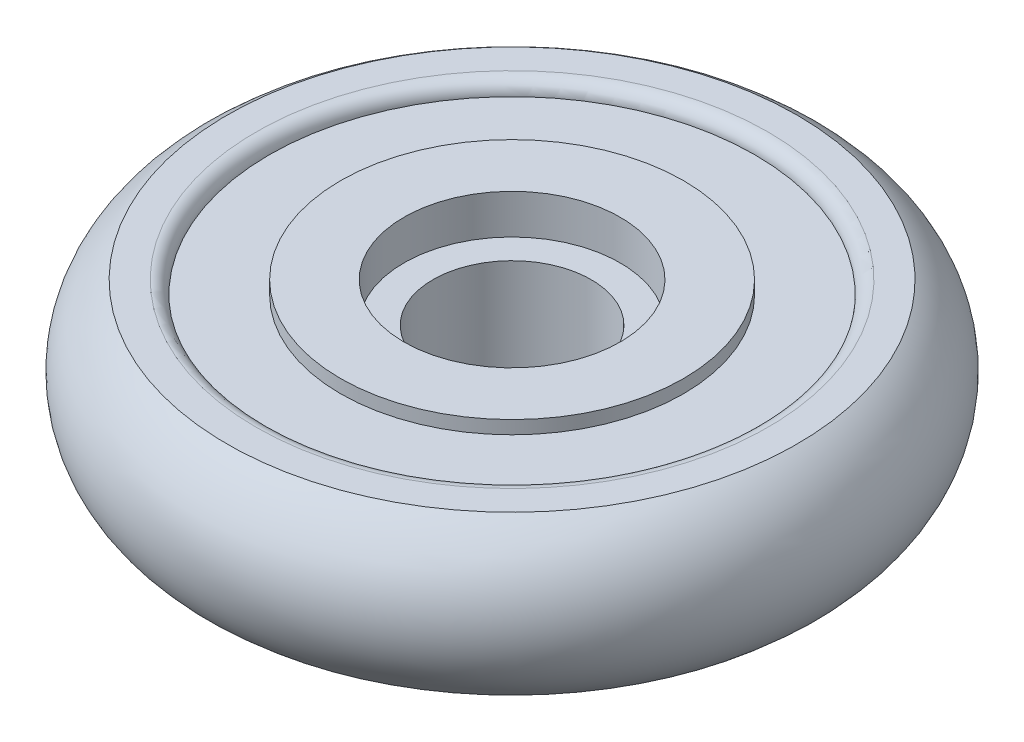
ISO-10303-21;
HEADER;
FILE_DESCRIPTION(('STEP AP214'),'2;1');
FILE_NAME('part.step','',(''),(''),'','','');
FILE_SCHEMA(('AUTOMOTIVE_DESIGN { 1 0 10303 214 1 1 1 1 }'));
ENDSEC;
DATA;
#1=APPLICATION_CONTEXT('core data for automotive mechanical design processes');
#2=APPLICATION_PROTOCOL_DEFINITION('international standard','automotive_design',2000,#1);
#3=PRODUCT_CONTEXT('',#1,'mechanical');
#4=PRODUCT('Part','Part','',(#3));
#5=PRODUCT_RELATED_PRODUCT_CATEGORY('part','',(#4));
#6=PRODUCT_DEFINITION_FORMATION('','',#4);
#7=PRODUCT_DEFINITION_CONTEXT('part definition',#1,'design');
#8=PRODUCT_DEFINITION('design','',#6,#7);
#9=PRODUCT_DEFINITION_SHAPE('','',#8);
#10=(LENGTH_UNIT() NAMED_UNIT(*) SI_UNIT(.MILLI.,.METRE.));
#11=(NAMED_UNIT(*) PLANE_ANGLE_UNIT() SI_UNIT($,.RADIAN.));
#12=(NAMED_UNIT(*) SI_UNIT($,.STERADIAN.) SOLID_ANGLE_UNIT());
#13=UNCERTAINTY_MEASURE_WITH_UNIT(LENGTH_MEASURE(1.E-05),#10,'distance_accuracy_value','');
#14=(GEOMETRIC_REPRESENTATION_CONTEXT(3) GLOBAL_UNCERTAINTY_ASSIGNED_CONTEXT((#13)) GLOBAL_UNIT_ASSIGNED_CONTEXT((#10,
#11,#12)) REPRESENTATION_CONTEXT('',''));
#15=CARTESIAN_POINT('',(0.,0.,0.));
#16=DIRECTION('',(0.,0.,1.));
#17=DIRECTION('',(1.,0.,0.));
#18=AXIS2_PLACEMENT_3D('',#15,#16,#17);
#19=CARTESIAN_POINT('',(0.,-8.99999999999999,0.));
#20=DIRECTION('',(0.,0.999999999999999,0.));
#21=DIRECTION('',(0.,0.,0.999999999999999));
#22=AXIS2_PLACEMENT_3D('',#19,#20,#21);
#23=CYLINDRICAL_SURFACE('',#22,3.);
#24=CARTESIAN_POINT('',(0.,-8.99999999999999,0.));
#25=DIRECTION('',(0.,0.999999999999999,0.));
#26=DIRECTION('',(0.,0.,0.999999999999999));
#27=AXIS2_PLACEMENT_3D('',#24,#25,#26);
#28=CIRCLE('',#27,3.);
#29=CARTESIAN_POINT('',(0.,-8.99999999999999,3.));
#30=VERTEX_POINT('',#29);
#31=EDGE_CURVE('E60',#30,#30,#28,.T.);
#32=CARTESIAN_POINT('',(0.,-1.5,0.));
#33=DIRECTION('',(0.,0.999999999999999,0.));
#34=DIRECTION('',(0.,0.,0.999999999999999));
#35=AXIS2_PLACEMENT_3D('',#32,#33,#34);
#36=CIRCLE('',#35,3.);
#37=CARTESIAN_POINT('',(0.,-1.5,3.));
#38=VERTEX_POINT('',#37);
#39=EDGE_CURVE('E82',#38,#38,#36,.T.);
#40=CARTESIAN_POINT('',(0.,-8.99999999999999,3.));
#41=CARTESIAN_POINT('',(0.,-8.92187499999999,3.));
#42=CARTESIAN_POINT('',(0.,-8.84374999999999,3.));
#43=CARTESIAN_POINT('',(0.,-8.68749999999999,3.));
#44=CARTESIAN_POINT('',(0.,-8.60937499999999,3.));
#45=CARTESIAN_POINT('',(0.,-8.45312499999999,3.));
#46=CARTESIAN_POINT('',(0.,-8.37499999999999,3.));
#47=CARTESIAN_POINT('',(0.,-8.21874999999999,3.));
#48=CARTESIAN_POINT('',(0.,-8.14062499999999,3.));
#49=CARTESIAN_POINT('',(0.,-7.98437499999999,3.));
#50=CARTESIAN_POINT('',(0.,-7.90624999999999,3.));
#51=CARTESIAN_POINT('',(0.,-7.74999999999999,3.));
#52=CARTESIAN_POINT('',(0.,-7.67187499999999,3.));
#53=CARTESIAN_POINT('',(0.,-7.51562499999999,3.));
#54=CARTESIAN_POINT('',(0.,-7.43749999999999,3.));
#55=CARTESIAN_POINT('',(0.,-7.28124999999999,3.));
#56=CARTESIAN_POINT('',(0.,-7.20312499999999,3.));
#57=CARTESIAN_POINT('',(0.,-7.04687499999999,3.));
#58=CARTESIAN_POINT('',(0.,-6.96874999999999,3.));
#59=CARTESIAN_POINT('',(0.,-6.81249999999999,3.));
#60=CARTESIAN_POINT('',(0.,-6.73437499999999,3.));
#61=CARTESIAN_POINT('',(0.,-6.57812499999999,3.));
#62=CARTESIAN_POINT('',(0.,-6.49999999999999,3.));
#63=CARTESIAN_POINT('',(0.,-6.34374999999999,3.));
#64=CARTESIAN_POINT('',(0.,-6.26562499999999,3.));
#65=CARTESIAN_POINT('',(0.,-6.10937499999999,3.));
#66=CARTESIAN_POINT('',(0.,-6.03124999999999,3.));
#67=CARTESIAN_POINT('',(0.,-5.87499999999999,3.));
#68=CARTESIAN_POINT('',(0.,-5.79687499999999,3.));
#69=CARTESIAN_POINT('',(0.,-5.64062499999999,3.));
#70=CARTESIAN_POINT('',(0.,-5.56249999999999,3.));
#71=CARTESIAN_POINT('',(0.,-5.40624999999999,3.));
#72=CARTESIAN_POINT('',(0.,-5.32812499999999,3.));
#73=CARTESIAN_POINT('',(0.,-5.17187499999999,3.));
#74=CARTESIAN_POINT('',(0.,-5.09374999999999,3.));
#75=CARTESIAN_POINT('',(0.,-4.93749999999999,3.));
#76=CARTESIAN_POINT('',(0.,-4.85937499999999,3.));
#77=CARTESIAN_POINT('',(0.,-4.70312499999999,3.));
#78=CARTESIAN_POINT('',(0.,-4.62499999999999,3.));
#79=CARTESIAN_POINT('',(0.,-4.46874999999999,3.));
#80=CARTESIAN_POINT('',(0.,-4.39062499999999,3.));
#81=CARTESIAN_POINT('',(0.,-4.23437499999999,3.));
#82=CARTESIAN_POINT('',(0.,-4.15624999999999,3.));
#83=CARTESIAN_POINT('',(0.,-3.99999999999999,3.));
#84=CARTESIAN_POINT('',(0.,-3.92187499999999,3.));
#85=CARTESIAN_POINT('',(0.,-3.765625,3.));
#86=CARTESIAN_POINT('',(0.,-3.6875,3.));
#87=CARTESIAN_POINT('',(0.,-3.53125,3.));
#88=CARTESIAN_POINT('',(0.,-3.453125,3.));
#89=CARTESIAN_POINT('',(0.,-3.296875,3.));
#90=CARTESIAN_POINT('',(0.,-3.21875,3.));
#91=CARTESIAN_POINT('',(0.,-3.0625,3.));
#92=CARTESIAN_POINT('',(0.,-2.984375,3.));
#93=CARTESIAN_POINT('',(0.,-2.828125,3.));
#94=CARTESIAN_POINT('',(0.,-2.75,3.));
#95=CARTESIAN_POINT('',(0.,-2.59375,3.));
#96=CARTESIAN_POINT('',(0.,-2.515625,3.));
#97=CARTESIAN_POINT('',(0.,-2.359375,3.));
#98=CARTESIAN_POINT('',(0.,-2.28125,3.));
#99=CARTESIAN_POINT('',(0.,-2.125,3.));
#100=CARTESIAN_POINT('',(0.,-2.046875,3.));
#101=CARTESIAN_POINT('',(0.,-1.890625,3.));
#102=CARTESIAN_POINT('',(0.,-1.8125,3.));
#103=CARTESIAN_POINT('',(0.,-1.65625,3.));
#104=CARTESIAN_POINT('',(0.,-1.578125,3.));
#105=CARTESIAN_POINT('',(0.,-1.5,3.));
#106=B_SPLINE_CURVE_WITH_KNOTS('',3,(#40,#41,#42,#43,#44,#45,#46,#47,#48,#49,#50,#51,#52,#53,
#54,#55,#56,#57,#58,#59,#60,#61,#62,#63,#64,#65,#66,#67,#68,#69,#70,#71,#72,#73,#74,#75,#76,#77,
#78,#79,#80,#81,#82,#83,#84,#85,#86,#87,#88,#89,#90,#91,#92,#93,#94,#95,#96,#97,#98,#99,#100,
#101,#102,#103,#104,#105),.UNSPECIFIED.,.F.,.F.,(4,2,2,2,2,2,2,2,2,2,2,2,2,2,2,2,2,2,2,2,2,2,2,
2,2,2,2,2,2,2,2,2,4),(0.,0.234375,0.46875,0.703124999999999,0.937499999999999,1.171875,1.40625,
1.640625,1.875,2.109375,2.34375,2.578125,2.8125,3.046875,3.28125,3.51562499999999,
3.74999999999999,3.98437499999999,4.21874999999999,4.45312499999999,4.68749999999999,
4.92187499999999,5.15624999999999,5.39062499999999,5.62499999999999,5.85937499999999,
6.09374999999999,6.32812499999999,6.56249999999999,6.79687499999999,7.03124999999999,
7.26562499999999,7.49999999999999),.UNSPECIFIED.);
#107=EDGE_CURVE('BSEAM34',#30,#38,#106,.T.);
#108=ORIENTED_EDGE('',*,*,#31,.F.);
#109=ORIENTED_EDGE('',*,*,#39,.T.);
#110=ORIENTED_EDGE('',*,*,#107,.T.);
#111=ORIENTED_EDGE('',*,*,#107,.F.);
#112=EDGE_LOOP('',(#108,#110,#109,#111));
#113=FACE_BOUND('',#112,.T.);
#114=ADVANCED_FACE('F34',(#113),#23,.F.);
#115=CARTESIAN_POINT('',(0.,0.,0.));
#116=DIRECTION('',(0.,0.999999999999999,0.));
#117=DIRECTION('',(0.,0.,0.999999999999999));
#118=AXIS2_PLACEMENT_3D('',#115,#116,#117);
#119=PLANE('',#118);
#120=CARTESIAN_POINT('',(0.,0.,0.));
#121=DIRECTION('',(0.,0.999999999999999,0.));
#122=DIRECTION('',(0.,0.,0.999999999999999));
#123=AXIS2_PLACEMENT_3D('',#120,#121,#122);
#124=CIRCLE('',#123,4.1);
#125=CARTESIAN_POINT('',(0.,0.,4.1));
#126=VERTEX_POINT('',#125);
#127=EDGE_CURVE('E79',#126,#126,#124,.T.);
#128=ORIENTED_EDGE('',*,*,#127,.F.);
#129=EDGE_LOOP('',(#128));
#130=FACE_BOUND('',#129,.T.);
#131=CARTESIAN_POINT('',(0.,0.,0.));
#132=DIRECTION('',(0.,0.999999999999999,0.));
#133=DIRECTION('',(0.,0.,0.999999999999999));
#134=AXIS2_PLACEMENT_3D('',#131,#132,#133);
#135=CIRCLE('',#134,6.5);
#136=CARTESIAN_POINT('',(0.,0.,6.5));
#137=VERTEX_POINT('',#136);
#138=EDGE_CURVE('E73',#137,#137,#135,.T.);
#139=ORIENTED_EDGE('',*,*,#138,.T.);
#140=EDGE_LOOP('',(#139));
#141=FACE_BOUND('',#140,.T.);
#142=ADVANCED_FACE('F102',(#130,#141),#119,.T.);
#143=CARTESIAN_POINT('',(0.,0.,0.));
#144=DIRECTION('',(0.,0.999999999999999,0.));
#145=DIRECTION('',(0.,0.,0.999999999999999));
#146=AXIS2_PLACEMENT_3D('',#143,#144,#145);
#147=CIRCLE('',#146,9.7);
#148=CARTESIAN_POINT('',(0.,0.,9.69999999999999));
#149=VERTEX_POINT('',#148);
#150=EDGE_CURVE('E45',#149,#149,#147,.F.);
#151=ORIENTED_EDGE('',*,*,#150,.T.);
#152=EDGE_LOOP('',(#151));
#153=FACE_BOUND('',#152,.T.);
#154=CARTESIAN_POINT('',(0.,0.,0.));
#155=DIRECTION('',(0.,-0.999999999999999,0.));
#156=DIRECTION('',(0.,0.,-0.999999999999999));
#157=AXIS2_PLACEMENT_3D('',#154,#155,#156);
#158=CIRCLE('',#157,10.802775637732);
#159=CARTESIAN_POINT('',(0.,0.,-10.802775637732));
#160=VERTEX_POINT('',#159);
#161=EDGE_CURVE('E54',#160,#160,#158,.T.);
#162=ORIENTED_EDGE('',*,*,#161,.F.);
#163=EDGE_LOOP('',(#162));
#164=FACE_BOUND('',#163,.T.);
#165=ADVANCED_FACE('F105',(#153,#164),#119,.T.);
#166=CARTESIAN_POINT('',(0.,-3.,0.));
#167=DIRECTION('',(0.,-0.999999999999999,0.));
#168=DIRECTION('',(0.,0.,-0.999999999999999));
#169=AXIS2_PLACEMENT_3D('',#166,#167,#168);
#170=TOROIDAL_SURFACE('',#169,9.,3.5);
#171=ORIENTED_EDGE('',*,*,#161,.T.);
#172=EDGE_LOOP('',(#171));
#173=FACE_BOUND('',#172,.T.);
#174=CARTESIAN_POINT('',(0.,-5.99999999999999,0.));
#175=DIRECTION('',(0.,-0.999999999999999,0.));
#176=DIRECTION('',(0.,0.,-0.999999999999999));
#177=AXIS2_PLACEMENT_3D('',#174,#175,#176);
#178=CIRCLE('',#177,10.802775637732);
#179=CARTESIAN_POINT('',(0.,-5.99999999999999,-10.802775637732));
#180=VERTEX_POINT('',#179);
#181=EDGE_CURVE('E57',#180,#180,#178,.T.);
#182=ORIENTED_EDGE('',*,*,#181,.F.);
#183=EDGE_LOOP('',(#182));
#184=FACE_BOUND('',#183,.T.);
#185=ADVANCED_FACE('F141',(#173,#184),#170,.T.);
#186=CARTESIAN_POINT('',(10.802775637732,-5.99999999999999,0.));
#187=DIRECTION('',(0.,-0.999999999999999,0.));
#188=DIRECTION('',(0.,0.,-0.999999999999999));
#189=AXIS2_PLACEMENT_3D('',#186,#187,#188);
#190=PLANE('',#189);
#191=CARTESIAN_POINT('',(0.,-5.99999999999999,0.));
#192=DIRECTION('',(0.,-0.999999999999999,0.));
#193=DIRECTION('',(0.,0.,-0.999999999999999));
#194=AXIS2_PLACEMENT_3D('',#191,#192,#193);
#195=CIRCLE('',#194,8.7);
#196=CARTESIAN_POINT('',(0.,-5.99999999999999,-8.69999999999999));
#197=VERTEX_POINT('',#196);
#198=EDGE_CURVE('E49',#197,#197,#195,.F.);
#199=ORIENTED_EDGE('',*,*,#198,.T.);
#200=EDGE_LOOP('',(#199));
#201=FACE_BOUND('',#200,.T.);
#202=ORIENTED_EDGE('',*,*,#181,.T.);
#203=EDGE_LOOP('',(#202));
#204=FACE_BOUND('',#203,.T.);
#205=ADVANCED_FACE('F138',(#201,#204),#190,.T.);
#206=CARTESIAN_POINT('',(0.,0.,0.));
#207=DIRECTION('',(0.,-0.999999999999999,0.));
#208=DIRECTION('',(0.,0.,-0.999999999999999));
#209=AXIS2_PLACEMENT_3D('',#206,#207,#208);
#210=CYLINDRICAL_SURFACE('',#209,5.5);
#211=CARTESIAN_POINT('',(0.,-8.79999999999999,0.));
#212=DIRECTION('',(0.,-0.999999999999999,0.));
#213=DIRECTION('',(0.,0.,-0.999999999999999));
#214=AXIS2_PLACEMENT_3D('',#211,#212,#213);
#215=CIRCLE('',#214,5.5);
#216=CARTESIAN_POINT('',(0.,-8.79999999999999,-5.5));
#217=VERTEX_POINT('',#216);
#218=EDGE_CURVE('E10',#217,#217,#215,.F.);
#219=CARTESIAN_POINT('',(0.,-5.49999999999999,0.));
#220=DIRECTION('',(0.,-0.999999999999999,0.));
#221=DIRECTION('',(0.,0.,-0.999999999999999));
#222=AXIS2_PLACEMENT_3D('',#219,#220,#221);
#223=CIRCLE('',#222,5.5);
#224=CARTESIAN_POINT('',(0.,-5.49999999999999,-5.5));
#225=VERTEX_POINT('',#224);
#226=EDGE_CURVE('E66',#225,#225,#223,.T.);
#227=CARTESIAN_POINT('',(0.,-8.79999999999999,-5.5));
#228=CARTESIAN_POINT('',(0.,-8.76562499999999,-5.5));
#229=CARTESIAN_POINT('',(0.,-8.73124999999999,-5.5));
#230=CARTESIAN_POINT('',(0.,-8.66249999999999,-5.5));
#231=CARTESIAN_POINT('',(0.,-8.62812499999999,-5.5));
#232=CARTESIAN_POINT('',(0.,-8.55937499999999,-5.5));
#233=CARTESIAN_POINT('',(0.,-8.52499999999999,-5.5));
#234=CARTESIAN_POINT('',(0.,-8.45624999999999,-5.5));
#235=CARTESIAN_POINT('',(0.,-8.42187499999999,-5.5));
#236=CARTESIAN_POINT('',(0.,-8.35312499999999,-5.5));
#237=CARTESIAN_POINT('',(0.,-8.31874999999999,-5.5));
#238=CARTESIAN_POINT('',(0.,-8.24999999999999,-5.5));
#239=CARTESIAN_POINT('',(0.,-8.21562499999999,-5.5));
#240=CARTESIAN_POINT('',(0.,-8.14687499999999,-5.5));
#241=CARTESIAN_POINT('',(0.,-8.11249999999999,-5.5));
#242=CARTESIAN_POINT('',(0.,-8.04374999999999,-5.5));
#243=CARTESIAN_POINT('',(0.,-8.00937499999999,-5.5));
#244=CARTESIAN_POINT('',(0.,-7.94062499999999,-5.5));
#245=CARTESIAN_POINT('',(0.,-7.90624999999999,-5.5));
#246=CARTESIAN_POINT('',(0.,-7.83749999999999,-5.5));
#247=CARTESIAN_POINT('',(0.,-7.80312499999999,-5.5));
#248=CARTESIAN_POINT('',(0.,-7.73437499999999,-5.5));
#249=CARTESIAN_POINT('',(0.,-7.69999999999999,-5.5));
#250=CARTESIAN_POINT('',(0.,-7.63124999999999,-5.5));
#251=CARTESIAN_POINT('',(0.,-7.59687499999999,-5.5));
#252=CARTESIAN_POINT('',(0.,-7.52812499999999,-5.5));
#253=CARTESIAN_POINT('',(0.,-7.49374999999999,-5.5));
#254=CARTESIAN_POINT('',(0.,-7.42499999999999,-5.5));
#255=CARTESIAN_POINT('',(0.,-7.39062499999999,-5.5));
#256=CARTESIAN_POINT('',(0.,-7.32187499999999,-5.5));
#257=CARTESIAN_POINT('',(0.,-7.28749999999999,-5.5));
#258=CARTESIAN_POINT('',(0.,-7.21874999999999,-5.5));
#259=CARTESIAN_POINT('',(0.,-7.18437499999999,-5.5));
#260=CARTESIAN_POINT('',(0.,-7.11562499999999,-5.5));
#261=CARTESIAN_POINT('',(0.,-7.08124999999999,-5.5));
#262=CARTESIAN_POINT('',(0.,-7.01249999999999,-5.5));
#263=CARTESIAN_POINT('',(0.,-6.97812499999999,-5.5));
#264=CARTESIAN_POINT('',(0.,-6.90937499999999,-5.5));
#265=CARTESIAN_POINT('',(0.,-6.87499999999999,-5.5));
#266=CARTESIAN_POINT('',(0.,-6.80624999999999,-5.5));
#267=CARTESIAN_POINT('',(0.,-6.77187499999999,-5.5));
#268=CARTESIAN_POINT('',(0.,-6.70312499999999,-5.5));
#269=CARTESIAN_POINT('',(0.,-6.66874999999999,-5.5));
#270=CARTESIAN_POINT('',(0.,-6.59999999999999,-5.5));
#271=CARTESIAN_POINT('',(0.,-6.56562499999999,-5.5));
#272=CARTESIAN_POINT('',(0.,-6.49687499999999,-5.5));
#273=CARTESIAN_POINT('',(0.,-6.46249999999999,-5.5));
#274=CARTESIAN_POINT('',(0.,-6.39374999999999,-5.5));
#275=CARTESIAN_POINT('',(0.,-6.35937499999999,-5.5));
#276=CARTESIAN_POINT('',(0.,-6.29062499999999,-5.5));
#277=CARTESIAN_POINT('',(0.,-6.25624999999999,-5.5));
#278=CARTESIAN_POINT('',(0.,-6.18749999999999,-5.5));
#279=CARTESIAN_POINT('',(0.,-6.15312499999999,-5.5));
#280=CARTESIAN_POINT('',(0.,-6.08437499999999,-5.5));
#281=CARTESIAN_POINT('',(0.,-6.04999999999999,-5.5));
#282=CARTESIAN_POINT('',(0.,-5.98124999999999,-5.5));
#283=CARTESIAN_POINT('',(0.,-5.94687499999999,-5.5));
#284=CARTESIAN_POINT('',(0.,-5.87812499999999,-5.5));
#285=CARTESIAN_POINT('',(0.,-5.84374999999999,-5.5));
#286=CARTESIAN_POINT('',(0.,-5.77499999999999,-5.5));
#287=CARTESIAN_POINT('',(0.,-5.74062499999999,-5.5));
#288=CARTESIAN_POINT('',(0.,-5.67187499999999,-5.5));
#289=CARTESIAN_POINT('',(0.,-5.63749999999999,-5.5));
#290=CARTESIAN_POINT('',(0.,-5.56874999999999,-5.5));
#291=CARTESIAN_POINT('',(0.,-5.53437499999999,-5.5));
#292=CARTESIAN_POINT('',(0.,-5.49999999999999,-5.5));
#293=B_SPLINE_CURVE_WITH_KNOTS('',3,(#227,#228,#229,#230,#231,#232,#233,#234,#235,#236,#237,
#238,#239,#240,#241,#242,#243,#244,#245,#246,#247,#248,#249,#250,#251,#252,#253,#254,#255,#256,
#257,#258,#259,#260,#261,#262,#263,#264,#265,#266,#267,#268,#269,#270,#271,#272,#273,#274,#275,
#276,#277,#278,#279,#280,#281,#282,#283,#284,#285,#286,#287,#288,#289,#290,#291,#292),
.UNSPECIFIED.,.F.,.F.,(4,2,2,2,2,2,2,2,2,2,2,2,2,2,2,2,2,2,2,2,2,2,2,2,2,2,2,2,2,2,2,2,4),(0.,
0.103124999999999,0.206249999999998,0.309374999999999,0.412499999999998,0.515624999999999,
0.618749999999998,0.721874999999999,0.824999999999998,0.928124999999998,1.03125,1.134375,1.2375,
1.340625,1.44375,1.546875,1.65,1.753125,1.85625,1.959375,2.0625,2.165625,2.26875,2.371875,2.475,
2.578125,2.68125,2.784375,2.8875,2.990625,3.09375,3.196875,3.3),.UNSPECIFIED.);
#294=EDGE_CURVE('BSEAM135',#217,#225,#293,.T.);
#295=ORIENTED_EDGE('',*,*,#218,.T.);
#296=ORIENTED_EDGE('',*,*,#226,.T.);
#297=ORIENTED_EDGE('',*,*,#294,.T.);
#298=ORIENTED_EDGE('',*,*,#294,.F.);
#299=EDGE_LOOP('',(#295,#297,#296,#298));
#300=FACE_BOUND('',#299,.T.);
#301=ADVANCED_FACE('F135',(#300),#210,.T.);
#302=CARTESIAN_POINT('',(5.50000000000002,-8.99999999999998,0.));
#303=DIRECTION('',(0.,-0.999999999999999,0.));
#304=DIRECTION('',(0.,0.,-0.999999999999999));
#305=AXIS2_PLACEMENT_3D('',#302,#303,#304);
#306=PLANE('',#305);
#307=CARTESIAN_POINT('',(0.,-8.99999999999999,0.));
#308=DIRECTION('',(0.,-0.999999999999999,0.));
#309=DIRECTION('',(0.,0.,-0.999999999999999));
#310=AXIS2_PLACEMENT_3D('',#307,#308,#309);
#311=CIRCLE('',#310,5.3);
#312=CARTESIAN_POINT('',(0.,-8.99999999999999,-5.3));
#313=VERTEX_POINT('',#312);
#314=EDGE_CURVE('E41',#313,#313,#311,.T.);
#315=ORIENTED_EDGE('',*,*,#314,.T.);
#316=EDGE_LOOP('',(#315));
#317=FACE_BOUND('',#316,.T.);
#318=ORIENTED_EDGE('',*,*,#31,.T.);
#319=EDGE_LOOP('',(#318));
#320=FACE_BOUND('',#319,.T.);
#321=ADVANCED_FACE('F132',(#317,#320),#306,.T.);
#322=CARTESIAN_POINT('',(0.,-5.49999999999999,0.));
#323=DIRECTION('',(0.,-0.999999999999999,0.));
#324=DIRECTION('',(0.,0.,-0.999999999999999));
#325=AXIS2_PLACEMENT_3D('',#322,#323,#324);
#326=PLANE('',#325);
#327=ORIENTED_EDGE('',*,*,#226,.F.);
#328=EDGE_LOOP('',(#327));
#329=FACE_BOUND('',#328,.T.);
#330=CARTESIAN_POINT('',(0.,-5.49999999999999,0.));
#331=DIRECTION('',(0.,-0.999999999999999,0.));
#332=DIRECTION('',(0.,0.,-0.999999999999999));
#333=AXIS2_PLACEMENT_3D('',#330,#331,#332);
#334=CIRCLE('',#333,8.2);
#335=CARTESIAN_POINT('',(0.,-5.49999999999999,-8.19999999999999));
#336=VERTEX_POINT('',#335);
#337=EDGE_CURVE('E63',#336,#336,#334,.T.);
#338=ORIENTED_EDGE('',*,*,#337,.T.);
#339=EDGE_LOOP('',(#338));
#340=FACE_BOUND('',#339,.T.);
#341=ADVANCED_FACE('F121',(#329,#340),#326,.T.);
#342=CARTESIAN_POINT('',(0.,-0.5,0.));
#343=DIRECTION('',(0.,0.999999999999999,0.));
#344=DIRECTION('',(0.,0.,0.999999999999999));
#345=AXIS2_PLACEMENT_3D('',#342,#343,#344);
#346=PLANE('',#345);
#347=CARTESIAN_POINT('',(0.,-0.5,0.));
#348=DIRECTION('',(0.,0.999999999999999,0.));
#349=DIRECTION('',(0.,0.,0.999999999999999));
#350=AXIS2_PLACEMENT_3D('',#347,#348,#349);
#351=CIRCLE('',#350,6.5);
#352=CARTESIAN_POINT('',(0.,-0.500000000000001,6.5));
#353=VERTEX_POINT('',#352);
#354=EDGE_CURVE('E72',#353,#353,#351,.T.);
#355=ORIENTED_EDGE('',*,*,#354,.F.);
#356=EDGE_LOOP('',(#355));
#357=FACE_BOUND('',#356,.T.);
#358=CARTESIAN_POINT('',(0.,-0.5,0.));
#359=DIRECTION('',(0.,0.999999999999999,0.));
#360=DIRECTION('',(0.,0.,0.999999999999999));
#361=AXIS2_PLACEMENT_3D('',#358,#359,#360);
#362=CIRCLE('',#361,9.2);
#363=CARTESIAN_POINT('',(0.,-0.5,9.19999999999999));
#364=VERTEX_POINT('',#363);
#365=EDGE_CURVE('E69',#364,#364,#362,.T.);
#366=ORIENTED_EDGE('',*,*,#365,.T.);
#367=EDGE_LOOP('',(#366));
#368=FACE_BOUND('',#367,.T.);
#369=ADVANCED_FACE('F112',(#357,#368),#346,.T.);
#370=CARTESIAN_POINT('',(0.,-0.5,0.));
#371=DIRECTION('',(0.,0.999999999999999,0.));
#372=DIRECTION('',(0.,0.,0.999999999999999));
#373=AXIS2_PLACEMENT_3D('',#370,#371,#372);
#374=CYLINDRICAL_SURFACE('',#373,6.5);
#375=CARTESIAN_POINT('',(0.,-0.500000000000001,6.5));
#376=CARTESIAN_POINT('',(0.,-0.494791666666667,6.5));
#377=CARTESIAN_POINT('',(0.,-0.489583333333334,6.5));
#378=CARTESIAN_POINT('',(0.,-0.479166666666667,6.5));
#379=CARTESIAN_POINT('',(0.,-0.473958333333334,6.5));
#380=CARTESIAN_POINT('',(0.,-0.463541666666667,6.5));
#381=CARTESIAN_POINT('',(0.,-0.458333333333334,6.5));
#382=CARTESIAN_POINT('',(0.,-0.447916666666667,6.5));
#383=CARTESIAN_POINT('',(0.,-0.442708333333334,6.5));
#384=CARTESIAN_POINT('',(0.,-0.432291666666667,6.5));
#385=CARTESIAN_POINT('',(0.,-0.427083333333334,6.5));
#386=CARTESIAN_POINT('',(0.,-0.416666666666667,6.5));
#387=CARTESIAN_POINT('',(0.,-0.411458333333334,6.5));
#388=CARTESIAN_POINT('',(0.,-0.401041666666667,6.5));
#389=CARTESIAN_POINT('',(0.,-0.395833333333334,6.5));
#390=CARTESIAN_POINT('',(0.,-0.385416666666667,6.5));
#391=CARTESIAN_POINT('',(0.,-0.380208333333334,6.5));
#392=CARTESIAN_POINT('',(0.,-0.369791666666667,6.5));
#393=CARTESIAN_POINT('',(0.,-0.364583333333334,6.5));
#394=CARTESIAN_POINT('',(0.,-0.354166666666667,6.5));
#395=CARTESIAN_POINT('',(0.,-0.348958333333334,6.5));
#396=CARTESIAN_POINT('',(0.,-0.338541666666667,6.5));
#397=CARTESIAN_POINT('',(0.,-0.333333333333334,6.5));
#398=CARTESIAN_POINT('',(0.,-0.322916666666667,6.5));
#399=CARTESIAN_POINT('',(0.,-0.317708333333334,6.5));
#400=CARTESIAN_POINT('',(0.,-0.307291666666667,6.5));
#401=CARTESIAN_POINT('',(0.,-0.302083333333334,6.5));
#402=CARTESIAN_POINT('',(0.,-0.291666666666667,6.5));
#403=CARTESIAN_POINT('',(0.,-0.286458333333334,6.5));
#404=CARTESIAN_POINT('',(0.,-0.276041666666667,6.5));
#405=CARTESIAN_POINT('',(0.,-0.270833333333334,6.5));
#406=CARTESIAN_POINT('',(0.,-0.260416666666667,6.5));
#407=CARTESIAN_POINT('',(0.,-0.255208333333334,6.5));
#408=CARTESIAN_POINT('',(0.,-0.244791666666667,6.5));
#409=CARTESIAN_POINT('',(0.,-0.239583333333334,6.5));
#410=CARTESIAN_POINT('',(0.,-0.229166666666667,6.5));
#411=CARTESIAN_POINT('',(0.,-0.223958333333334,6.5));
#412=CARTESIAN_POINT('',(0.,-0.213541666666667,6.5));
#413=CARTESIAN_POINT('',(0.,-0.208333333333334,6.5));
#414=CARTESIAN_POINT('',(0.,-0.197916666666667,6.5));
#415=CARTESIAN_POINT('',(0.,-0.192708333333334,6.5));
#416=CARTESIAN_POINT('',(0.,-0.182291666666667,6.5));
#417=CARTESIAN_POINT('',(0.,-0.177083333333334,6.5));
#418=CARTESIAN_POINT('',(0.,-0.166666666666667,6.5));
#419=CARTESIAN_POINT('',(0.,-0.161458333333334,6.5));
#420=CARTESIAN_POINT('',(0.,-0.151041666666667,6.5));
#421=CARTESIAN_POINT('',(0.,-0.145833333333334,6.5));
#422=CARTESIAN_POINT('',(0.,-0.135416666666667,6.5));
#423=CARTESIAN_POINT('',(0.,-0.130208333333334,6.5));
#424=CARTESIAN_POINT('',(0.,-0.119791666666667,6.5));
#425=CARTESIAN_POINT('',(0.,-0.114583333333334,6.5));
#426=CARTESIAN_POINT('',(0.,-0.104166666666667,6.5));
#427=CARTESIAN_POINT('',(0.,-0.0989583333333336,6.5));
#428=CARTESIAN_POINT('',(0.,-0.0885416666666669,6.5));
#429=CARTESIAN_POINT('',(0.,-0.0833333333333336,6.5));
#430=CARTESIAN_POINT('',(0.,-0.0729166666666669,6.5));
#431=CARTESIAN_POINT('',(0.,-0.0677083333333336,6.5));
#432=CARTESIAN_POINT('',(0.,-0.0572916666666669,6.5));
#433=CARTESIAN_POINT('',(0.,-0.0520833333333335,6.5));
#434=CARTESIAN_POINT('',(0.,-0.0416666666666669,6.5));
#435=CARTESIAN_POINT('',(0.,-0.0364583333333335,6.5));
#436=CARTESIAN_POINT('',(0.,-0.0260416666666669,6.5));
#437=CARTESIAN_POINT('',(0.,-0.0208333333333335,6.5));
#438=CARTESIAN_POINT('',(0.,-0.0104166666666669,6.5));
#439=CARTESIAN_POINT('',(0.,-0.00520833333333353,6.5));
#440=CARTESIAN_POINT('',(0.,0.,6.5));
#441=B_SPLINE_CURVE_WITH_KNOTS('',3,(#375,#376,#377,#378,#379,#380,#381,#382,#383,#384,#385,
#386,#387,#388,#389,#390,#391,#392,#393,#394,#395,#396,#397,#398,#399,#400,#401,#402,#403,#404,
#405,#406,#407,#408,#409,#410,#411,#412,#413,#414,#415,#416,#417,#418,#419,#420,#421,#422,#423,
#424,#425,#426,#427,#428,#429,#430,#431,#432,#433,#434,#435,#436,#437,#438,#439,#440),
.UNSPECIFIED.,.F.,.F.,(4,2,2,2,2,2,2,2,2,2,2,2,2,2,2,2,2,2,2,2,2,2,2,2,2,2,2,2,2,2,2,2,4),(0.,
0.0156250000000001,0.0312500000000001,0.0468750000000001,0.0625000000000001,0.0781250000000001,
0.0937500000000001,0.109375,0.125,0.140625,0.15625,0.171875,0.1875,0.203125,0.21875,0.234375,
0.25,0.265625,0.28125,0.296875,0.3125,0.328125,0.34375,0.359375,0.375,0.390625,0.40625,0.421875,
0.4375,0.453125,0.46875,0.484375,0.5),.UNSPECIFIED.);
#442=EDGE_CURVE('BSEAM109',#353,#137,#441,.T.);
#443=ORIENTED_EDGE('',*,*,#354,.T.);
#444=ORIENTED_EDGE('',*,*,#138,.F.);
#445=ORIENTED_EDGE('',*,*,#442,.T.);
#446=ORIENTED_EDGE('',*,*,#442,.F.);
#447=EDGE_LOOP('',(#443,#445,#444,#446));
#448=FACE_BOUND('',#447,.T.);
#449=ADVANCED_FACE('F109',(#448),#374,.T.);
#450=CARTESIAN_POINT('',(0.,-5.49999999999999,0.));
#451=DIRECTION('',(0.,-0.999999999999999,0.));
#452=DIRECTION('',(0.,0.,-0.999999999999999));
#453=AXIS2_PLACEMENT_3D('',#450,#451,#452);
#454=TOROIDAL_SURFACE('',#453,8.7,0.5);
#455=ORIENTED_EDGE('',*,*,#198,.F.);
#456=EDGE_LOOP('',(#455));
#457=FACE_BOUND('',#456,.T.);
#458=ORIENTED_EDGE('',*,*,#337,.F.);
#459=EDGE_LOOP('',(#458));
#460=FACE_BOUND('',#459,.T.);
#461=ADVANCED_FACE('F111',(#457,#460),#454,.T.);
#462=CARTESIAN_POINT('',(0.,-0.5,0.));
#463=DIRECTION('',(0.,0.999999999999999,0.));
#464=DIRECTION('',(0.,0.,0.999999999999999));
#465=AXIS2_PLACEMENT_3D('',#462,#463,#464);
#466=TOROIDAL_SURFACE('',#465,9.7,0.5);
#467=ORIENTED_EDGE('',*,*,#150,.F.);
#468=EDGE_LOOP('',(#467));
#469=FACE_BOUND('',#468,.T.);
#470=ORIENTED_EDGE('',*,*,#365,.F.);
#471=EDGE_LOOP('',(#470));
#472=FACE_BOUND('',#471,.T.);
#473=ADVANCED_FACE('F98',(#469,#472),#466,.T.);
#474=CARTESIAN_POINT('',(0.,-1.5,0.));
#475=DIRECTION('',(0.,0.999999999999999,0.));
#476=DIRECTION('',(0.,0.,0.999999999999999));
#477=AXIS2_PLACEMENT_3D('',#474,#475,#476);
#478=CYLINDRICAL_SURFACE('',#477,4.1);
#479=CARTESIAN_POINT('',(0.,-1.5,0.));
#480=DIRECTION('',(0.,0.999999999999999,0.));
#481=DIRECTION('',(0.,0.,0.999999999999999));
#482=AXIS2_PLACEMENT_3D('',#479,#480,#481);
#483=CIRCLE('',#482,4.1);
#484=CARTESIAN_POINT('',(0.,-1.5,4.1));
#485=VERTEX_POINT('',#484);
#486=EDGE_CURVE('E76',#485,#485,#483,.T.);
#487=CARTESIAN_POINT('',(0.,-1.5,4.1));
#488=CARTESIAN_POINT('',(0.,-1.484375,4.1));
#489=CARTESIAN_POINT('',(0.,-1.46875,4.1));
#490=CARTESIAN_POINT('',(0.,-1.4375,4.1));
#491=CARTESIAN_POINT('',(0.,-1.421875,4.1));
#492=CARTESIAN_POINT('',(0.,-1.390625,4.1));
#493=CARTESIAN_POINT('',(0.,-1.375,4.1));
#494=CARTESIAN_POINT('',(0.,-1.34375,4.1));
#495=CARTESIAN_POINT('',(0.,-1.328125,4.1));
#496=CARTESIAN_POINT('',(0.,-1.296875,4.1));
#497=CARTESIAN_POINT('',(0.,-1.28125,4.1));
#498=CARTESIAN_POINT('',(0.,-1.25,4.1));
#499=CARTESIAN_POINT('',(0.,-1.234375,4.1));
#500=CARTESIAN_POINT('',(0.,-1.203125,4.1));
#501=CARTESIAN_POINT('',(0.,-1.1875,4.1));
#502=CARTESIAN_POINT('',(0.,-1.15625,4.1));
#503=CARTESIAN_POINT('',(0.,-1.140625,4.1));
#504=CARTESIAN_POINT('',(0.,-1.109375,4.1));
#505=CARTESIAN_POINT('',(0.,-1.09375,4.1));
#506=CARTESIAN_POINT('',(0.,-1.0625,4.1));
#507=CARTESIAN_POINT('',(0.,-1.046875,4.1));
#508=CARTESIAN_POINT('',(0.,-1.015625,4.1));
#509=CARTESIAN_POINT('',(0.,-1.,4.1));
#510=CARTESIAN_POINT('',(0.,-0.96875,4.1));
#511=CARTESIAN_POINT('',(0.,-0.953125,4.1));
#512=CARTESIAN_POINT('',(0.,-0.921875,4.1));
#513=CARTESIAN_POINT('',(0.,-0.90625,4.1));
#514=CARTESIAN_POINT('',(0.,-0.875,4.1));
#515=CARTESIAN_POINT('',(0.,-0.859375,4.1));
#516=CARTESIAN_POINT('',(0.,-0.828125,4.1));
#517=CARTESIAN_POINT('',(0.,-0.8125,4.1));
#518=CARTESIAN_POINT('',(0.,-0.78125,4.1));
#519=CARTESIAN_POINT('',(0.,-0.765625,4.1));
#520=CARTESIAN_POINT('',(0.,-0.734375,4.1));
#521=CARTESIAN_POINT('',(0.,-0.71875,4.1));
#522=CARTESIAN_POINT('',(0.,-0.6875,4.1));
#523=CARTESIAN_POINT('',(0.,-0.671875,4.1));
#524=CARTESIAN_POINT('',(0.,-0.640625,4.1));
#525=CARTESIAN_POINT('',(0.,-0.625,4.1));
#526=CARTESIAN_POINT('',(0.,-0.59375,4.1));
#527=CARTESIAN_POINT('',(0.,-0.578125,4.1));
#528=CARTESIAN_POINT('',(0.,-0.546875,4.1));
#529=CARTESIAN_POINT('',(0.,-0.53125,4.1));
#530=CARTESIAN_POINT('',(0.,-0.5,4.1));
#531=CARTESIAN_POINT('',(0.,-0.484375,4.1));
#532=CARTESIAN_POINT('',(0.,-0.453125,4.1));
#533=CARTESIAN_POINT('',(0.,-0.4375,4.1));
#534=CARTESIAN_POINT('',(0.,-0.40625,4.1));
#535=CARTESIAN_POINT('',(0.,-0.390625,4.1));
#536=CARTESIAN_POINT('',(0.,-0.359375,4.1));
#537=CARTESIAN_POINT('',(0.,-0.34375,4.1));
#538=CARTESIAN_POINT('',(0.,-0.3125,4.1));
#539=CARTESIAN_POINT('',(0.,-0.296875,4.1));
#540=CARTESIAN_POINT('',(0.,-0.265625,4.1));
#541=CARTESIAN_POINT('',(0.,-0.25,4.1));
#542=CARTESIAN_POINT('',(0.,-0.21875,4.1));
#543=CARTESIAN_POINT('',(0.,-0.203125,4.1));
#544=CARTESIAN_POINT('',(0.,-0.171875,4.1));
#545=CARTESIAN_POINT('',(0.,-0.15625,4.1));
#546=CARTESIAN_POINT('',(0.,-0.125,4.1));
#547=CARTESIAN_POINT('',(0.,-0.109375,4.1));
#548=CARTESIAN_POINT('',(0.,-0.0781250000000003,4.1));
#549=CARTESIAN_POINT('',(0.,-0.0625000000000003,4.1));
#550=CARTESIAN_POINT('',(0.,-0.0312500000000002,4.1));
#551=CARTESIAN_POINT('',(0.,-0.0156250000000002,4.1));
#552=CARTESIAN_POINT('',(0.,0.,4.1));
#553=B_SPLINE_CURVE_WITH_KNOTS('',3,(#487,#488,#489,#490,#491,#492,#493,#494,#495,#496,#497,
#498,#499,#500,#501,#502,#503,#504,#505,#506,#507,#508,#509,#510,#511,#512,#513,#514,#515,#516,
#517,#518,#519,#520,#521,#522,#523,#524,#525,#526,#527,#528,#529,#530,#531,#532,#533,#534,#535,
#536,#537,#538,#539,#540,#541,#542,#543,#544,#545,#546,#547,#548,#549,#550,#551,#552),
.UNSPECIFIED.,.F.,.F.,(4,2,2,2,2,2,2,2,2,2,2,2,2,2,2,2,2,2,2,2,2,2,2,2,2,2,2,2,2,2,2,2,4),(0.,
0.046875,0.0937500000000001,0.140625,0.1875,0.234375,0.28125,0.328125,0.375,0.421875,0.46875,
0.515625,0.5625,0.609375,0.65625,0.703125,0.75,0.796875,0.84375,0.890625,0.9375,0.984375,
1.03125,1.078125,1.125,1.171875,1.21875,1.265625,1.3125,1.359375,1.40625,1.453125,1.5),.UNSPECIFIED.);
#554=EDGE_CURVE('BSEAM92',#485,#126,#553,.T.);
#555=ORIENTED_EDGE('',*,*,#486,.F.);
#556=ORIENTED_EDGE('',*,*,#127,.T.);
#557=ORIENTED_EDGE('',*,*,#554,.T.);
#558=ORIENTED_EDGE('',*,*,#554,.F.);
#559=EDGE_LOOP('',(#555,#557,#556,#558));
#560=FACE_BOUND('',#559,.T.);
#561=ADVANCED_FACE('F92',(#560),#478,.F.);
#562=CARTESIAN_POINT('',(0.,-1.5,0.));
#563=DIRECTION('',(0.,0.999999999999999,0.));
#564=DIRECTION('',(0.,0.,0.999999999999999));
#565=AXIS2_PLACEMENT_3D('',#562,#563,#564);
#566=PLANE('',#565);
#567=ORIENTED_EDGE('',*,*,#39,.F.);
#568=EDGE_LOOP('',(#567));
#569=FACE_BOUND('',#568,.T.);
#570=ORIENTED_EDGE('',*,*,#486,.T.);
#571=EDGE_LOOP('',(#570));
#572=FACE_BOUND('',#571,.T.);
#573=ADVANCED_FACE('F89',(#569,#572),#566,.T.);
#574=CARTESIAN_POINT('',(0.,-8.99999999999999,0.));
#575=DIRECTION('',(0.,0.999999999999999,0.));
#576=DIRECTION('',(0.,0.,0.999999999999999));
#577=AXIS2_PLACEMENT_3D('',#574,#575,#576);
#578=CONICAL_SURFACE('',#577,5.3,0.785398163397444);
#579=ORIENTED_EDGE('',*,*,#218,.F.);
#580=EDGE_LOOP('',(#579));
#581=FACE_BOUND('',#580,.T.);
#582=ORIENTED_EDGE('',*,*,#314,.F.);
#583=EDGE_LOOP('',(#582));
#584=FACE_BOUND('',#583,.T.);
#585=ADVANCED_FACE('F36',(#581,#584),#578,.T.);
#586=CLOSED_SHELL('',(#114,#142,#165,#185,#205,#301,#321,#341,#369,#449,#461,#473,#561,#573,#585));
#587=MANIFOLD_SOLID_BREP('B2',#586);
#588=ADVANCED_BREP_SHAPE_REPRESENTATION('',(#18,#587),#14);
#589=SHAPE_DEFINITION_REPRESENTATION(#9,#588);
ENDSEC;
END-ISO-10303-21;
